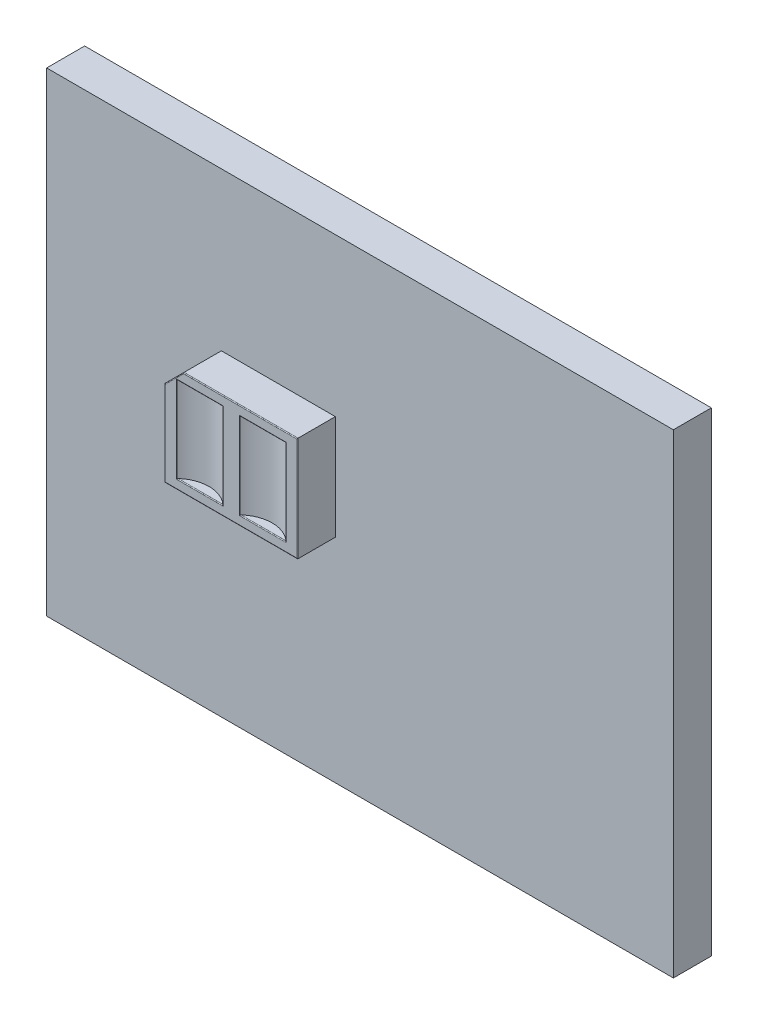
from build123d import *

# Parameters (mm, degrees)
ESQUISSE1_W             = 16.5
ESQUISSE1_H             = 12.5
EXTRUSION1_DEPTH        = 1
EXTRUSION2_DEPTH        = 2
ENL_V_MAT_EXTRU_1_DEPTH = 2.25
CONG_1_R                = 0.02


with BuildPart() as part:
    # Esquisse1 → Extrusion1 (new body)
    with BuildSketch(Plane.XY):
        Rectangle(ESQUISSE1_W, ESQUISSE1_H)
    extrude(amount=EXTRUSION1_DEPTH)

    # Esquisse3 → Extrusion2 (add)
    with BuildSketch(Plane.XY):
        Polygon((-3.65, 2.1), (-0.65, 2.1), (-0.65, -0.65), (-4.15, -0.65), (-4.15, 1.6), align=None)
    extrude(amount=EXTRUSION2_DEPTH)

    # Esquisse4 → Enl_v. mat.-Extru.1 (cut)
    with BuildSketch(Plane.XZ.offset(0.4)):
        with BuildLine():
            Line((-2.168200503, 2), (-0.947989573, 2))
            ThreePointArc((-0.947989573, 2), (-1.558095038, 1.755105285), (-2.168200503, 2))
        make_face()
        with BuildLine():
            Line((-2.607402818, 2), (-3.827613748, 2))
            ThreePointArc((-3.827613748, 2), (-3.217508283, 1.755105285), (-2.607402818, 2))
        make_face()
    extrude(amount=-ENL_V_MAT_EXTRU_1_DEPTH, mode=Mode.SUBTRACT)

    # Cong_1
    cong_1_edges = [part.edges().sort_by_distance(p)[0] for p in [
        (-2.15, 2.1, 2),
        (-0.65, 0.725, 2),
        (-2.4, -0.65, 2),
        (-4.15, 0.475, 2),
        (-3.9, 1.85, 2),
        (-2.168200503, 0.725, 2),
        (-1.558095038, 1.85, 2),
        (-0.947989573, 0.725, 2),
        (-1.558095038, -0.4, 2),
        (-3.217508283, -0.4, 2),
        (-3.827613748, 0.725, 2),
        (-3.217508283, 1.85, 2),
        (-2.607402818, 0.725, 2),
    ]]
    fillet(cong_1_edges, radius=CONG_1_R)


solid = part.part
